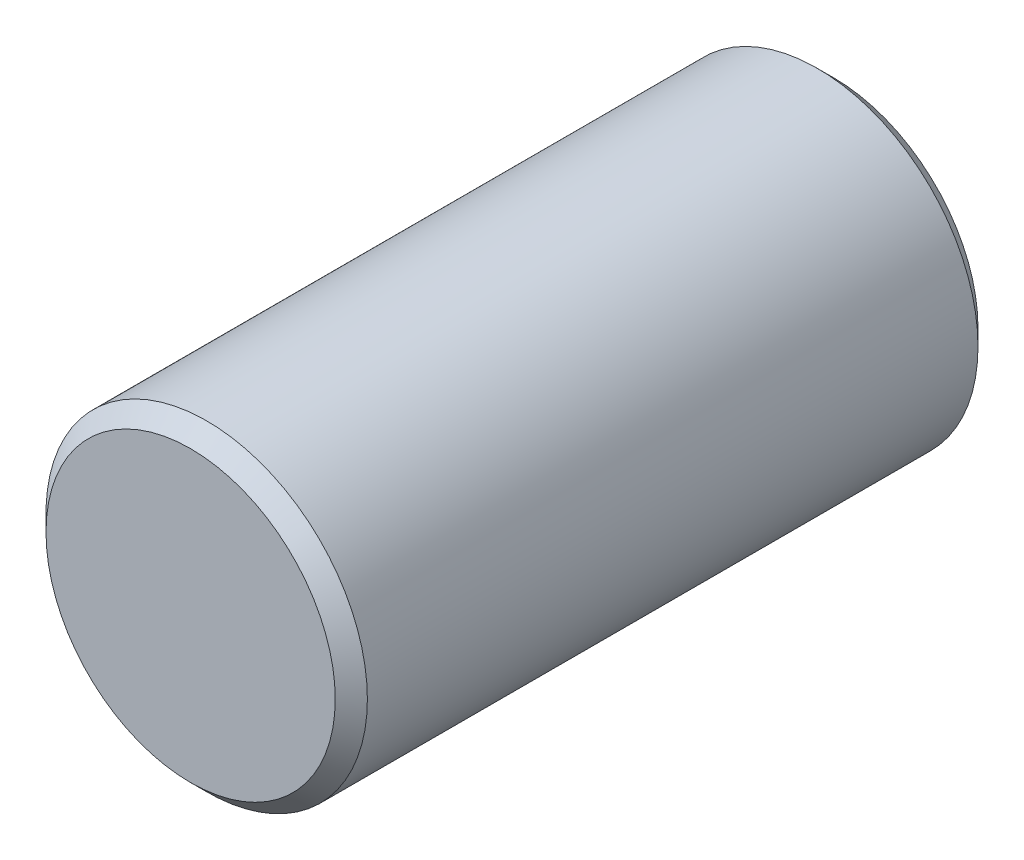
ISO-10303-21;
HEADER;
FILE_DESCRIPTION(('STEP AP214'),'2;1');
FILE_NAME('part.step','',(''),(''),'','','');
FILE_SCHEMA(('AUTOMOTIVE_DESIGN { 1 0 10303 214 1 1 1 1 }'));
ENDSEC;
DATA;
#1=APPLICATION_CONTEXT('core data for automotive mechanical design processes');
#2=APPLICATION_PROTOCOL_DEFINITION('international standard','automotive_design',2000,#1);
#3=PRODUCT_CONTEXT('',#1,'mechanical');
#4=PRODUCT('Part','Part','',(#3));
#5=PRODUCT_RELATED_PRODUCT_CATEGORY('part','',(#4));
#6=PRODUCT_DEFINITION_FORMATION('','',#4);
#7=PRODUCT_DEFINITION_CONTEXT('part definition',#1,'design');
#8=PRODUCT_DEFINITION('design','',#6,#7);
#9=PRODUCT_DEFINITION_SHAPE('','',#8);
#10=(LENGTH_UNIT() NAMED_UNIT(*) SI_UNIT(.MILLI.,.METRE.));
#11=(NAMED_UNIT(*) PLANE_ANGLE_UNIT() SI_UNIT($,.RADIAN.));
#12=(NAMED_UNIT(*) SI_UNIT($,.STERADIAN.) SOLID_ANGLE_UNIT());
#13=UNCERTAINTY_MEASURE_WITH_UNIT(LENGTH_MEASURE(1.E-05),#10,'distance_accuracy_value','');
#14=(GEOMETRIC_REPRESENTATION_CONTEXT(3) GLOBAL_UNCERTAINTY_ASSIGNED_CONTEXT((#13)) GLOBAL_UNIT_ASSIGNED_CONTEXT((#10,
#11,#12)) REPRESENTATION_CONTEXT('',''));
#15=CARTESIAN_POINT('',(0.,0.,0.));
#16=DIRECTION('',(0.,0.,1.));
#17=DIRECTION('',(1.,0.,0.));
#18=AXIS2_PLACEMENT_3D('',#15,#16,#17);
#19=CARTESIAN_POINT('',(0.,0.,4.));
#20=DIRECTION('',(0.,0.,-1.));
#21=DIRECTION('',(-1.,0.,0.));
#22=AXIS2_PLACEMENT_3D('',#19,#20,#21);
#23=CYLINDRICAL_SURFACE('',#22,1.);
#24=CARTESIAN_POINT('',(0.,0.,0.1));
#25=DIRECTION('',(0.,0.,1.));
#26=DIRECTION('',(1.,0.,0.));
#27=AXIS2_PLACEMENT_3D('',#24,#25,#26);
#28=CIRCLE('',#27,1.);
#29=CARTESIAN_POINT('',(1.,0.,0.1));
#30=VERTEX_POINT('',#29);
#31=EDGE_CURVE('E371',#30,#30,#28,.T.);
#32=ORIENTED_EDGE('',*,*,#31,.T.);
#33=EDGE_LOOP('',(#32));
#34=FACE_BOUND('',#33,.T.);
#35=CARTESIAN_POINT('',(0.,0.,3.9));
#36=DIRECTION('',(0.,0.,1.));
#37=DIRECTION('',(1.,0.,0.));
#38=AXIS2_PLACEMENT_3D('',#35,#36,#37);
#39=CIRCLE('',#38,1.);
#40=CARTESIAN_POINT('',(1.,0.,3.9));
#41=VERTEX_POINT('',#40);
#42=EDGE_CURVE('E375',#41,#41,#39,.F.);
#43=ORIENTED_EDGE('',*,*,#42,.T.);
#44=EDGE_LOOP('',(#43));
#45=FACE_BOUND('',#44,.T.);
#46=ADVANCED_FACE('F361',(#34,#45),#23,.T.);
#47=CARTESIAN_POINT('',(0.,0.,4.));
#48=DIRECTION('',(0.,0.,1.));
#49=DIRECTION('',(1.,0.,0.));
#50=AXIS2_PLACEMENT_3D('',#47,#48,#49);
#51=PLANE('',#50);
#52=CARTESIAN_POINT('',(0.,0.,4.));
#53=DIRECTION('',(0.,0.,1.));
#54=DIRECTION('',(1.,0.,0.));
#55=AXIS2_PLACEMENT_3D('',#52,#53,#54);
#56=CIRCLE('',#55,0.900000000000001);
#57=CARTESIAN_POINT('',(0.900000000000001,0.,4.));
#58=VERTEX_POINT('',#57);
#59=EDGE_CURVE('E10',#58,#58,#56,.T.);
#60=ORIENTED_EDGE('',*,*,#59,.T.);
#61=EDGE_LOOP('',(#60));
#62=FACE_BOUND('',#61,.T.);
#63=ADVANCED_FACE('F394',(#62),#51,.T.);
#64=CARTESIAN_POINT('',(0.,0.,0.));
#65=DIRECTION('',(0.,0.,1.));
#66=DIRECTION('',(1.,0.,0.));
#67=AXIS2_PLACEMENT_3D('',#64,#65,#66);
#68=PLANE('',#67);
#69=CARTESIAN_POINT('',(0.,0.,0.));
#70=DIRECTION('',(0.,0.,1.));
#71=DIRECTION('',(1.,0.,0.));
#72=AXIS2_PLACEMENT_3D('',#69,#70,#71);
#73=CIRCLE('',#72,0.9);
#74=CARTESIAN_POINT('',(0.9,0.,0.));
#75=VERTEX_POINT('',#74);
#76=EDGE_CURVE('E367',#75,#75,#73,.F.);
#77=ORIENTED_EDGE('',*,*,#76,.T.);
#78=EDGE_LOOP('',(#77));
#79=FACE_BOUND('',#78,.T.);
#80=ADVANCED_FACE('F390',(#79),#68,.F.);
#81=CARTESIAN_POINT('',(0.,0.,0.1));
#82=DIRECTION('',(0.,0.,1.));
#83=DIRECTION('',(1.,0.,0.));
#84=AXIS2_PLACEMENT_3D('',#81,#82,#83);
#85=CONICAL_SURFACE('',#84,1.,0.785398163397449);
#86=ORIENTED_EDGE('',*,*,#76,.F.);
#87=EDGE_LOOP('',(#86));
#88=FACE_BOUND('',#87,.T.);
#89=ORIENTED_EDGE('',*,*,#31,.F.);
#90=EDGE_LOOP('',(#89));
#91=FACE_BOUND('',#90,.T.);
#92=ADVANCED_FACE('F385',(#88,#91),#85,.T.);
#93=CARTESIAN_POINT('',(0.,0.,4.));
#94=DIRECTION('',(0.,0.,-1.));
#95=DIRECTION('',(-1.,0.,0.));
#96=AXIS2_PLACEMENT_3D('',#93,#94,#95);
#97=CONICAL_SURFACE('',#96,0.900000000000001,0.785398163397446);
#98=ORIENTED_EDGE('',*,*,#42,.F.);
#99=EDGE_LOOP('',(#98));
#100=FACE_BOUND('',#99,.T.);
#101=ORIENTED_EDGE('',*,*,#59,.F.);
#102=EDGE_LOOP('',(#101));
#103=FACE_BOUND('',#102,.T.);
#104=ADVANCED_FACE('F382',(#100,#103),#97,.T.);
#105=CLOSED_SHELL('',(#46,#63,#80,#92,#104));
#106=MANIFOLD_SOLID_BREP('B2',#105);
#107=ADVANCED_BREP_SHAPE_REPRESENTATION('',(#18,#106),#14);
#108=SHAPE_DEFINITION_REPRESENTATION(#9,#107);
ENDSEC;
END-ISO-10303-21;
